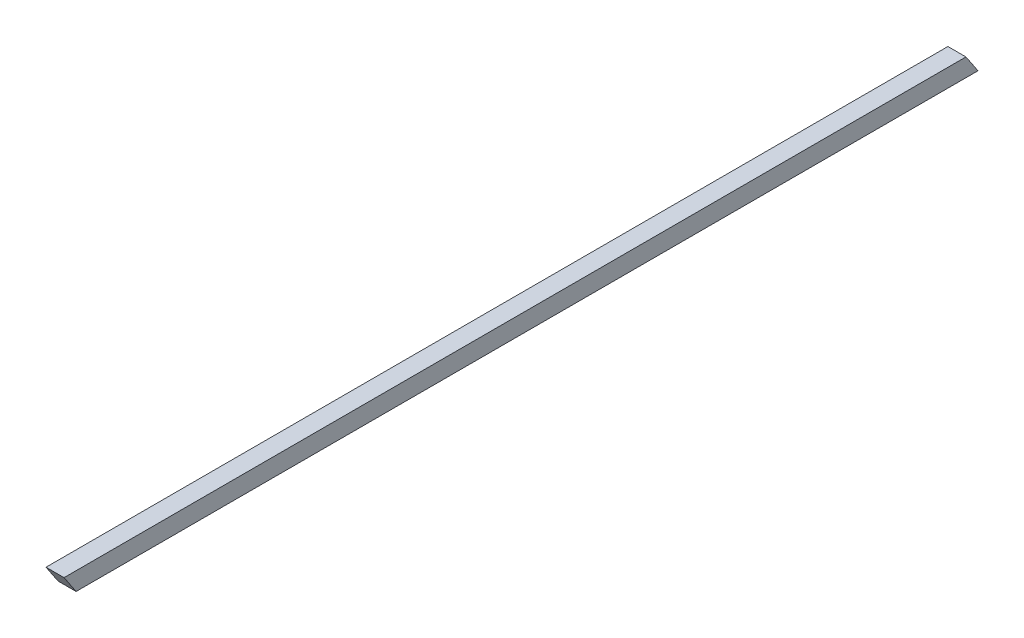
from build123d import *

# Parameters (mm, degrees)
ESQUISSE1_W             = 4
ESQUISSE1_H             = 4
EXTRUSION1_DEPTH        = 100
ENL_V_MAT_EXTRU_1_DEPTH = 300
EXTRUSION2_DEPTH        = 4


with BuildPart() as part:
    # Esquisse1 → Extrusion1 (new, symmetric)
    with BuildSketch(Plane.XY):
        Rectangle(ESQUISSE1_W, ESQUISSE1_H)
    extrude(amount=EXTRUSION1_DEPTH, both=True)

    # Esquisse2 → Enl_v. mat.-Extru.1 (cut)
    with BuildSketch(Plane.ZY.offset(2)):
        Polygon((-100, -2), (-97.325662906, 2), (-100, 2), align=None)
    extrude(amount=-ENL_V_MAT_EXTRU_1_DEPTH, mode=Mode.SUBTRACT)

    # Esquisse3 → Extrusion2 (add)
    with BuildSketch(Plane.ZY.offset(2)):
        Polygon((100, 2), (100, -2), (102.674337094, 2), align=None)
    extrude(amount=-EXTRUSION2_DEPTH)


solid = part.part
